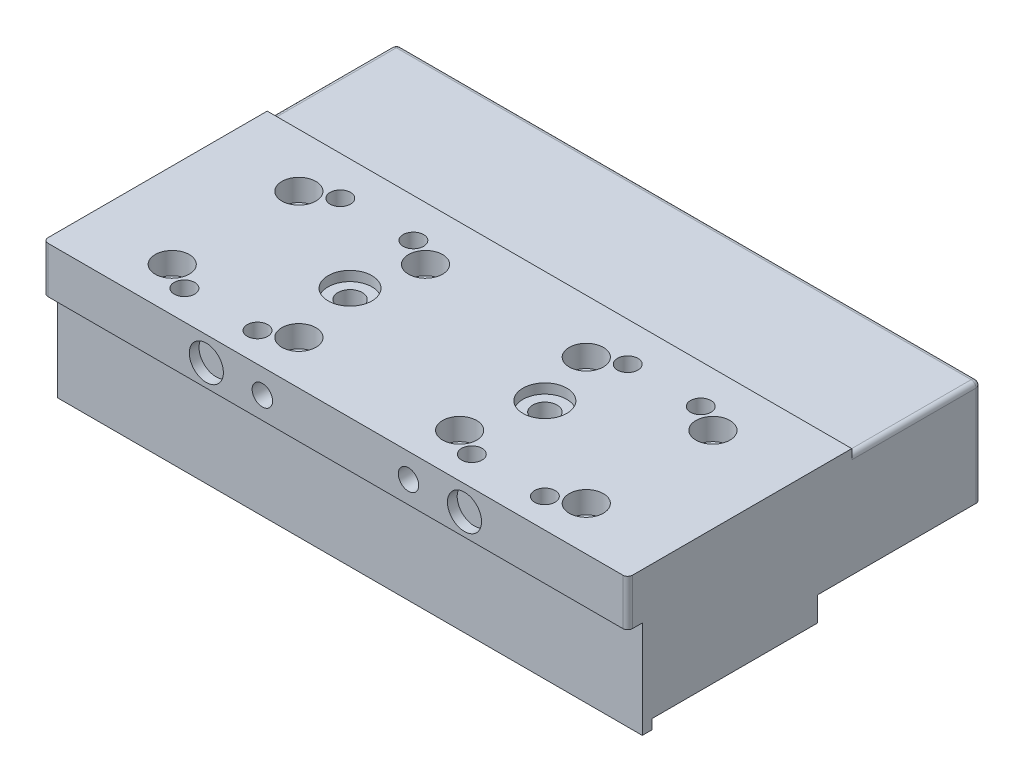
from build123d import *

# Parameters (mm, degrees)
SKETCH_1_W                   = 120
SKETCH_1_H                   = 72.5
EXTRUDE_1_DEPTH              = 22.5
SKETCH_2_W                   = 120
SKETCH_2_H                   = 26.5
CUT_EXTRUDE_1_DEPTH          = 1
SKETCH_3_W                   = 120
SKETCH_3_H                   = 39
CUT_EXTRUDE_2_DEPTH          = 13
SKETCH_36_W                  = 8
SKETCH_36_H                  = 18
SKETCH_36_W_2                = 10
EXTRUDE_2_DEPTH              = 120
HOLE_WIZARD_1_D              = 4.5
HOLE_WIZARD_1_CBORE_D        = 7
HOLE_WIZARD_1_CBORE_DEPTH    = 4.5
HOLE_WIZARD_M4_1_D           = 3.2
HOLE_WIZARD_M4_1_DEPTH       = 11
HOLE_WIZARD_M4_1_CSINK_D     = 4.05
HOLE_WIZARD_M4_1_CSINK_ANGLE = 90
HOLE_WIZARD_M4_1_TIP         = 0.96137699
HOLE_WIZARD_M5_1_D           = 4.2
HOLE_WIZARD_M5_1_DEPTH       = 14.5
HOLE_WIZARD_M5_1_TIP         = 1.2618073
HOLE_WIZARD_M5_2_D           = 4.2
HOLE_WIZARD_M5_2_DEPTH       = 10
HOLE_WIZARD_M5_2_TIP         = 1.2618073
HOLE_WIZARD_M5_3_D           = 4.2
HOLE_WIZARD_M5_3_DEPTH       = 5.2
HOLE_WIZARD_M5_3_TIP         = 0.562693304
SKETCH_21_R                  = 3.5
CUT_EXTRUDE_6_DEPTH          = 2
FILLET_1_R                   = 1
SKETCH_31_R                  = 4.5
CUT_EXTRUDE_7_DEPTH          = 2
HOLE_WIZARD_M6_1_AT_2_COUNT  = 2
HOLE_WIZARD_M6_1_AT_2_PITCH  = 40
HOLE_WIZARD_M5_5_D           = 4.2
HOLE_WIZARD_M5_5_DEPTH       = 16.4
HOLE_WIZARD_M5_5_TIP         = 1.2618073
SKETCH_37_W                  = 2
SKETCH_37_H                  = 2
EXTRUDE_3_DEPTH              = 120
SKETCH_38_W                  = 18
SKETCH_38_H                  = 18
EXTRUDE_4_DEPTH              = 120


with BuildPart() as part:
    # Sketch 1 → Extrude 1 (new body)
    with BuildSketch(Plane(origin=(0, 0, 0), x_dir=(1, 0, 0), z_dir=(0, 1, 0))):
        Rectangle(SKETCH_1_W, SKETCH_1_H)
    extrude(amount=EXTRUDE_1_DEPTH)

    # Sketch 2 → Cut-Extrude 1 (cut)
    with BuildSketch(Plane(origin=(0, 22.5, 0), x_dir=(1, 0, 0), z_dir=(0, 1, 0))):
        with Locations((0, 23)):
            Rectangle(SKETCH_2_W, SKETCH_2_H)
    extrude(amount=-CUT_EXTRUDE_1_DEPTH, mode=Mode.SUBTRACT)

    # Sketch 3 → Cut-Extrude 2 (cut)
    with BuildSketch(Plane.XZ):
        with Locations((0, 16.75)):
            Rectangle(SKETCH_3_W, SKETCH_3_H)
    extrude(amount=-CUT_EXTRUDE_2_DEPTH, mode=Mode.SUBTRACT)

    # Sketch 36 → Extrude 2 (add)
    with BuildSketch(Plane.ZY.offset(60)):
        with Locations((1.25, 4)):
            Rectangle(SKETCH_36_W, SKETCH_36_H)
        with Locations((28.25, 4)):
            Rectangle(SKETCH_36_W_2, SKETCH_36_H)
    extrude(amount=-EXTRUDE_2_DEPTH)

    # Hole Wizard 1 (through all)
    with Locations(Plane(origin=(0, 22.5, 0), x_dir=(1, 0, 0), z_dir=(0, 1, 0))):
        with Locations((-42.5, -27.25), (-42.5, -1.25), (-16.5, -1.25), (-16.5, -27.25), (16.5, -1.25), (16.5, -27.25), (42.5, -27.25), (42.5, -1.25)):
            CounterBoreHole(HOLE_WIZARD_1_D / 2, HOLE_WIZARD_1_CBORE_D / 2, HOLE_WIZARD_1_CBORE_DEPTH)

    # Hole Wizard M4 _1
    with Locations(Plane(origin=(0, 0, -36.25), x_dir=(-1, 0, 0), z_dir=(0, 0, -1))):
        with Locations((-39, 6.5), (39, 6.5)):
            CounterSinkHole(HOLE_WIZARD_M4_1_D / 2, HOLE_WIZARD_M4_1_CSINK_D / 2, depth=HOLE_WIZARD_M4_1_DEPTH, counter_sink_angle=HOLE_WIZARD_M4_1_CSINK_ANGLE)
            with Locations((0, 0, -(HOLE_WIZARD_M4_1_DEPTH + HOLE_WIZARD_M4_1_TIP / 2))):  # 118° drill point
                Cone(0, HOLE_WIZARD_M4_1_D / 2, HOLE_WIZARD_M4_1_TIP, mode=Mode.SUBTRACT)

    # Hole Wizard M5 _1
    with Locations(Plane(origin=(0, 0, -36.25), x_dir=(-1, 0, 0), z_dir=(0, 0, -1))):
        with Locations((-15, 17.5), (15, 17.5)):
            Hole(HOLE_WIZARD_M5_1_D / 2, depth=HOLE_WIZARD_M5_1_DEPTH)
            with Locations((0, 0, -(HOLE_WIZARD_M5_1_DEPTH + HOLE_WIZARD_M5_1_TIP / 2))):  # 118° drill point
                Cone(0, HOLE_WIZARD_M5_1_D / 2, HOLE_WIZARD_M5_1_TIP, mode=Mode.SUBTRACT)

    # Hole Wizard M5 _2
    with Locations(Plane(origin=(0, 22.5, 0), x_dir=(1, 0, 0), z_dir=(0, 1, 0))):
        with Locations((-37, 1.75), (-22, 1.75), (22, 1.75), (37, 1.75), (37, -30.25), (22, -30.25), (-22, -30.25), (-37, -30.25)):
            Hole(HOLE_WIZARD_M5_2_D / 2, depth=HOLE_WIZARD_M5_2_DEPTH)
            with Locations((0, 0, -(HOLE_WIZARD_M5_2_DEPTH + HOLE_WIZARD_M5_2_TIP / 2))):  # 118° drill point
                Cone(0, HOLE_WIZARD_M5_2_D / 2, HOLE_WIZARD_M5_2_TIP, mode=Mode.SUBTRACT)

    # Hole Wizard M5 _3
    with Locations(Plane.XY.offset(36.25)):
        with Locations((-15, 17.5), (15, 17.5)):
            Hole(HOLE_WIZARD_M5_3_D / 2, depth=HOLE_WIZARD_M5_3_DEPTH)
            with Locations((0, 0, -(HOLE_WIZARD_M5_3_DEPTH + HOLE_WIZARD_M5_3_TIP / 2))):  # 150° drill point
                Cone(0, HOLE_WIZARD_M5_3_D / 2, HOLE_WIZARD_M5_3_TIP, mode=Mode.SUBTRACT)

    # Sketch 21 → Cut-Extrude 6 (cut)
    with BuildSketch(Plane.XY.offset(36.25)):
        with Locations((-26.5, 17.5)):
            Circle(SKETCH_21_R)
        with Locations((26.5, 17.5)):
            Circle(SKETCH_21_R)
    extrude(amount=-CUT_EXTRUDE_6_DEPTH, mode=Mode.SUBTRACT)

    # Fillet 1
    fillet_1_edges = [part.edges().sort_by_distance(p)[0] for p in [
        (-60, 10.75, -36.25),
        (60, 10.75, -36.25),
        (-60, 21.5, -23),
        (0, 21.5, -36.25),
        (60, 21.5, -23),
        (60, 17.75, 36.25),
        (-60, 17.75, 36.25),
    ]]
    fillet(fillet_1_edges, radius=FILLET_1_R)

    # Sketch 31 → Cut-Extrude 7 (cut)
    with BuildSketch(Plane.XZ.offset(-22.5)):
        with Locations(Location((-20, 13.25, 0), (0, 0, 270))):
            Circle(SKETCH_31_R)
        with Locations(Location((20, 13.25, 0), (0, 0, 270))):
            Circle(SKETCH_31_R)
    extrude(amount=CUT_EXTRUDE_7_DEPTH, mode=Mode.SUBTRACT)

    # Sketch 33 → Hole Wizard M6 _1 (revolve, cut)
    with BuildSketch(Plane(origin=(20, 22.5, 13.25), x_dir=(0, 0, 1), z_dir=(1, 0, 0))):
        Polygon((0, 0), (0, 9.5), (3.025, 9.5), (2.5, 8.975), (2.5, 0.525), (3.025, 0), align=None)
    hole_wizard_m6_1 = revolve(axis=Axis((20, 28.85, 13.25), (0, -1, 0)), mode=Mode.SUBTRACT)

    # Hole Wizard M6 _1 at 2: Hole Wizard M6 _1 ×2
    with Locations(*[(-i * HOLE_WIZARD_M6_1_AT_2_PITCH, 0, 0) for i in range(1, HOLE_WIZARD_M6_1_AT_2_COUNT)]):
        add(hole_wizard_m6_1, mode=Mode.SUBTRACT)

    # Hole Wizard M5 _5
    with Locations(Plane(origin=(0, 0, -36.25), x_dir=(-1, 0, 0), z_dir=(0, 0, -1))):
        with Locations((-3, 17.5)):
            Hole(HOLE_WIZARD_M5_5_D / 2, depth=HOLE_WIZARD_M5_5_DEPTH)
            with Locations((0, 0, -(HOLE_WIZARD_M5_5_DEPTH + HOLE_WIZARD_M5_5_TIP / 2))):  # 118° drill point
                Cone(0, HOLE_WIZARD_M5_5_D / 2, HOLE_WIZARD_M5_5_TIP, mode=Mode.SUBTRACT)

    # Sketch 37 → Extrude 3 (add)
    with BuildSketch(Plane.ZY.offset(60)):
        with Locations((32.25, -6)):
            Rectangle(SKETCH_37_W, SKETCH_37_H)
    extrude(amount=-EXTRUDE_3_DEPTH)

    # Sketch 38 → Extrude 4 (add)
    with BuildSketch(Plane.ZY.offset(60)):
        with Locations((14.25, 4)):
            Rectangle(SKETCH_38_W, SKETCH_38_H)
    extrude(amount=-EXTRUDE_4_DEPTH)


solid = part.part
